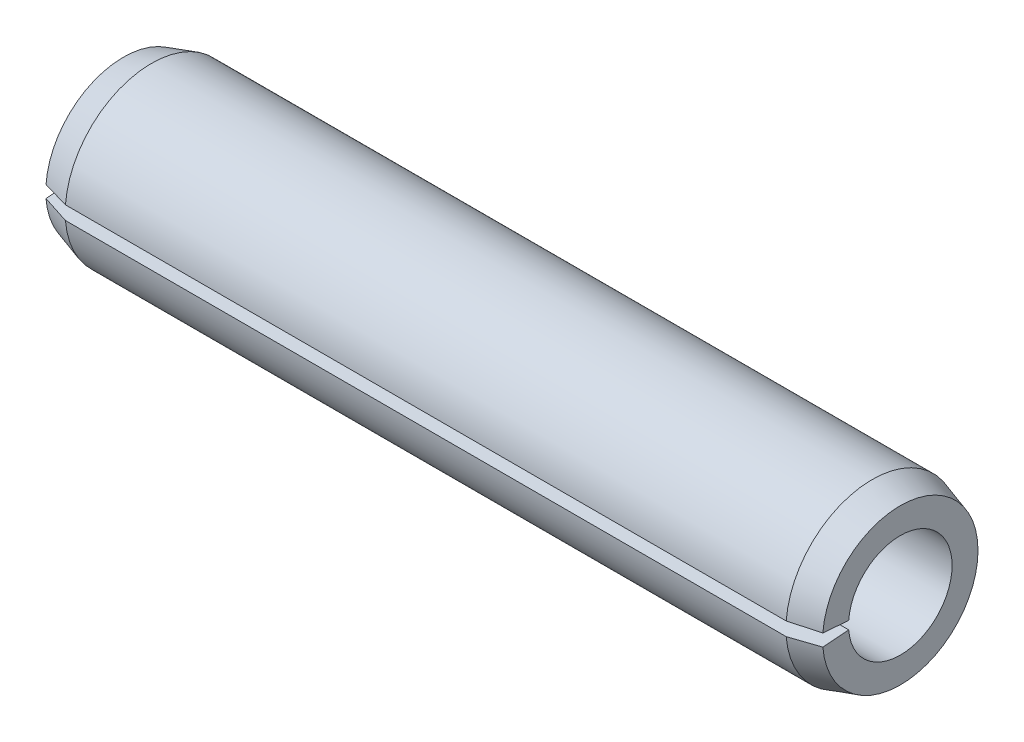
from build123d import *

# Parameters (mm, degrees)
GAP_DEPTH = 19.220867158


with BuildPart() as part:
    # Sketch1 → Base-Revolve (revolve)
    with BuildSketch(Plane.XY, mode=Mode.PRIVATE) as base_revolve_sk:
        Polygon((0, 1.2), (18, 1.2), (18, 1.8), (17.35, 2), (0.65, 2), (0, 1.8), align=None)
    revolve(base_revolve_sk.sketch.rotate(Axis((-9.525, 0, 0), (1, 0, 0)), 90), axis=Axis((-9.525, 0, 0), (1, 0, 0)))

    # Sketch2 → Gap (cut, through all)
    with BuildSketch(Plane(origin=(0, 0, 0), x_dir=(0, -1, 0), z_dir=(-1, 0, 0))):
        with BuildLine():
            Line((0, 0), (0.160056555, 2.033711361))
            ThreePointArc((0.160056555, 2.033711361), (0, 2.04), (-0.160056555, 2.033711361))
            Line((-0.160056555, 2.033711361), (0, 0))
        make_face()
    extrude(amount=-GAP_DEPTH, mode=Mode.SUBTRACT)


solid = part.part
